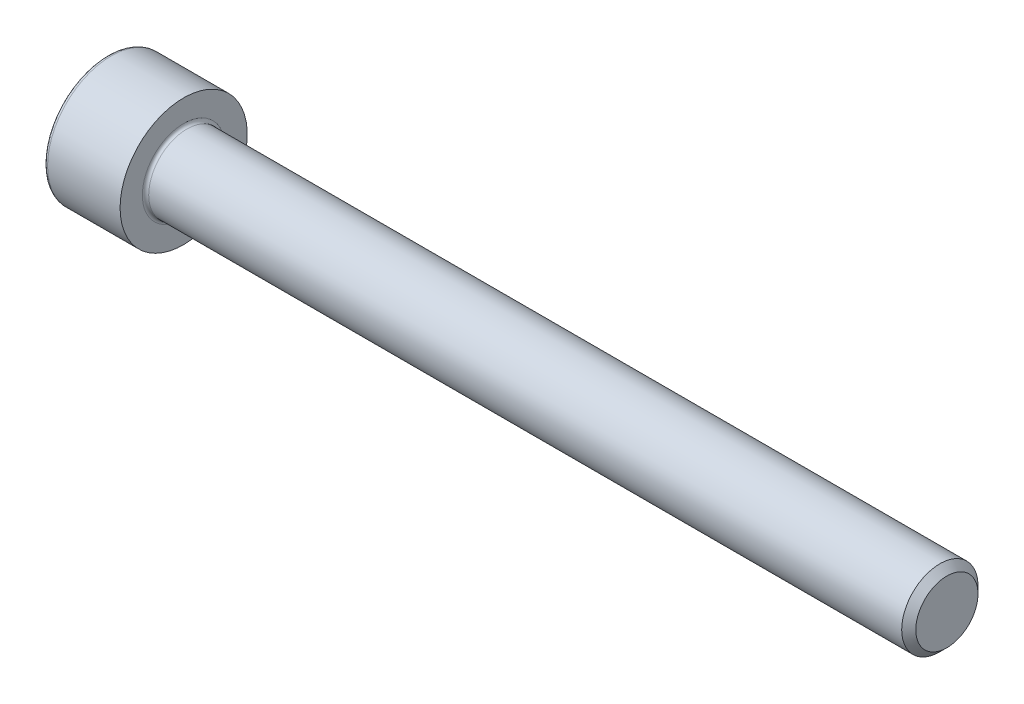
ISO-10303-21;
HEADER;
FILE_DESCRIPTION(('STEP AP214'),'2;1');
FILE_NAME('part.step','',(''),(''),'','','');
FILE_SCHEMA(('AUTOMOTIVE_DESIGN { 1 0 10303 214 1 1 1 1 }'));
ENDSEC;
DATA;
#1=APPLICATION_CONTEXT('core data for automotive mechanical design processes');
#2=APPLICATION_PROTOCOL_DEFINITION('international standard','automotive_design',2000,#1);
#3=PRODUCT_CONTEXT('',#1,'mechanical');
#4=PRODUCT('Part','Part','',(#3));
#5=PRODUCT_RELATED_PRODUCT_CATEGORY('part','',(#4));
#6=PRODUCT_DEFINITION_FORMATION('','',#4);
#7=PRODUCT_DEFINITION_CONTEXT('part definition',#1,'design');
#8=PRODUCT_DEFINITION('design','',#6,#7);
#9=PRODUCT_DEFINITION_SHAPE('','',#8);
#10=(LENGTH_UNIT() NAMED_UNIT(*) SI_UNIT(.MILLI.,.METRE.));
#11=(NAMED_UNIT(*) PLANE_ANGLE_UNIT() SI_UNIT($,.RADIAN.));
#12=(NAMED_UNIT(*) SI_UNIT($,.STERADIAN.) SOLID_ANGLE_UNIT());
#13=UNCERTAINTY_MEASURE_WITH_UNIT(LENGTH_MEASURE(1.E-05),#10,'distance_accuracy_value','');
#14=(GEOMETRIC_REPRESENTATION_CONTEXT(3) GLOBAL_UNCERTAINTY_ASSIGNED_CONTEXT((#13)) GLOBAL_UNIT_ASSIGNED_CONTEXT((#10,
#11,#12)) REPRESENTATION_CONTEXT('',''));
#15=CARTESIAN_POINT('',(0.,0.,0.));
#16=DIRECTION('',(0.,0.,1.));
#17=DIRECTION('',(1.,0.,0.));
#18=AXIS2_PLACEMENT_3D('',#15,#16,#17);
#19=CARTESIAN_POINT('',(0.,0.,0.));
#20=DIRECTION('',(-1.,0.,0.));
#21=DIRECTION('',(0.,0.,1.));
#22=AXIS2_PLACEMENT_3D('',#19,#20,#21);
#23=PLANE('',#22);
#24=DIRECTION('',(0.,-0.499999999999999,0.866025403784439));
#25=VECTOR('',#24,1.);
#26=CARTESIAN_POINT('',(0.,2.93524876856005,0.));
#27=LINE('',#26,#25);
#28=CARTESIAN_POINT('',(0.,2.93524876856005,0.));
#29=VERTEX_POINT('',#28);
#30=CARTESIAN_POINT('',(0.,1.46762438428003,2.542));
#31=VERTEX_POINT('',#30);
#32=EDGE_CURVE('E262',#29,#31,#27,.T.);
#33=ORIENTED_EDGE('',*,*,#32,.T.);
#34=DIRECTION('',(0.,1.,0.));
#35=VECTOR('',#34,1.);
#36=CARTESIAN_POINT('',(0.,-1.46762438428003,2.542));
#37=LINE('',#36,#35);
#38=CARTESIAN_POINT('',(0.,-1.46762438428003,2.542));
#39=VERTEX_POINT('',#38);
#40=EDGE_CURVE('E123',#39,#31,#37,.T.);
#41=ORIENTED_EDGE('',*,*,#40,.F.);
#42=DIRECTION('',(0.,-0.500000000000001,-0.866025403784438));
#43=VECTOR('',#42,1.);
#44=CARTESIAN_POINT('',(0.,-1.46762438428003,2.542));
#45=LINE('',#44,#43);
#46=CARTESIAN_POINT('',(0.,-2.93524876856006,0.));
#47=VERTEX_POINT('',#46);
#48=EDGE_CURVE('E265',#39,#47,#45,.T.);
#49=ORIENTED_EDGE('',*,*,#48,.T.);
#50=DIRECTION('',(0.,0.499999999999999,-0.866025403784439));
#51=VECTOR('',#50,1.);
#52=CARTESIAN_POINT('',(0.,-2.93524876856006,0.));
#53=LINE('',#52,#51);
#54=CARTESIAN_POINT('',(0.,-1.46762438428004,-2.542));
#55=VERTEX_POINT('',#54);
#56=EDGE_CURVE('E268',#47,#55,#53,.T.);
#57=ORIENTED_EDGE('',*,*,#56,.T.);
#58=DIRECTION('',(0.,-1.,0.));
#59=VECTOR('',#58,1.);
#60=CARTESIAN_POINT('',(0.,1.46762438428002,-2.542));
#61=LINE('',#60,#59);
#62=CARTESIAN_POINT('',(0.,1.46762438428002,-2.542));
#63=VERTEX_POINT('',#62);
#64=EDGE_CURVE('E271',#63,#55,#61,.T.);
#65=ORIENTED_EDGE('',*,*,#64,.F.);
#66=DIRECTION('',(0.,-0.500000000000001,-0.866025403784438));
#67=VECTOR('',#66,1.);
#68=CARTESIAN_POINT('',(0.,2.93524876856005,0.));
#69=LINE('',#68,#67);
#70=EDGE_CURVE('E118',#29,#63,#69,.T.);
#71=ORIENTED_EDGE('',*,*,#70,.F.);
#72=EDGE_LOOP('',(#33,#41,#49,#57,#65,#71));
#73=FACE_BOUND('',#72,.T.);
#74=CARTESIAN_POINT('',(0.,0.,0.));
#75=DIRECTION('',(-1.,0.,0.));
#76=DIRECTION('',(0.,0.,1.));
#77=AXIS2_PLACEMENT_3D('',#74,#75,#76);
#78=CIRCLE('',#77,4.7);
#79=CARTESIAN_POINT('',(0.,0.,4.7));
#80=VERTEX_POINT('',#79);
#81=EDGE_CURVE('E39',#80,#80,#78,.T.);
#82=ORIENTED_EDGE('',*,*,#81,.T.);
#83=EDGE_LOOP('',(#82));
#84=FACE_BOUND('',#83,.T.);
#85=ADVANCED_FACE('F31',(#73,#84),#23,.T.);
#86=CARTESIAN_POINT('',(-31.75,0.,0.));
#87=DIRECTION('',(-1.,0.,0.));
#88=DIRECTION('',(0.,0.,1.));
#89=AXIS2_PLACEMENT_3D('',#86,#87,#88);
#90=CYLINDRICAL_SURFACE('',#89,5.);
#91=CARTESIAN_POINT('',(0.300000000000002,0.,0.));
#92=DIRECTION('',(-1.,0.,0.));
#93=DIRECTION('',(0.,0.,1.));
#94=AXIS2_PLACEMENT_3D('',#91,#92,#93);
#95=CIRCLE('',#94,5.);
#96=CARTESIAN_POINT('',(0.300000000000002,0.,5.));
#97=VERTEX_POINT('',#96);
#98=EDGE_CURVE('E11',#97,#97,#95,.F.);
#99=ORIENTED_EDGE('',*,*,#98,.T.);
#100=EDGE_LOOP('',(#99));
#101=FACE_BOUND('',#100,.T.);
#102=CARTESIAN_POINT('',(6.,0.,0.));
#103=DIRECTION('',(-1.,0.,0.));
#104=DIRECTION('',(0.,0.,1.));
#105=AXIS2_PLACEMENT_3D('',#102,#103,#104);
#106=CIRCLE('',#105,5.);
#107=CARTESIAN_POINT('',(6.,0.,5.));
#108=VERTEX_POINT('',#107);
#109=EDGE_CURVE('E141',#108,#108,#106,.T.);
#110=ORIENTED_EDGE('',*,*,#109,.T.);
#111=EDGE_LOOP('',(#110));
#112=FACE_BOUND('',#111,.T.);
#113=ADVANCED_FACE('F165',(#101,#112),#90,.T.);
#114=CARTESIAN_POINT('',(6.,5.,0.));
#115=DIRECTION('',(1.,0.,0.));
#116=DIRECTION('',(0.,0.,-1.));
#117=AXIS2_PLACEMENT_3D('',#114,#115,#116);
#118=PLANE('',#117);
#119=CARTESIAN_POINT('',(6.,0.,0.));
#120=DIRECTION('',(1.,0.,0.));
#121=DIRECTION('',(0.,0.,-1.));
#122=AXIS2_PLACEMENT_3D('',#119,#120,#121);
#123=CIRCLE('',#122,3.24999999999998);
#124=CARTESIAN_POINT('',(6.,0.,-3.24999999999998));
#125=VERTEX_POINT('',#124);
#126=EDGE_CURVE('E144',#125,#125,#123,.F.);
#127=ORIENTED_EDGE('',*,*,#126,.T.);
#128=EDGE_LOOP('',(#127));
#129=FACE_BOUND('',#128,.T.);
#130=ORIENTED_EDGE('',*,*,#109,.F.);
#131=EDGE_LOOP('',(#130));
#132=FACE_BOUND('',#131,.T.);
#133=ADVANCED_FACE('F171',(#129,#132),#118,.T.);
#134=CARTESIAN_POINT('',(-31.75,0.,0.));
#135=DIRECTION('',(-1.,0.,0.));
#136=DIRECTION('',(0.,0.,1.));
#137=AXIS2_PLACEMENT_3D('',#134,#135,#136);
#138=CYLINDRICAL_SURFACE('',#137,2.99999999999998);
#139=CARTESIAN_POINT('',(6.25,0.,0.));
#140=DIRECTION('',(1.,0.,0.));
#141=DIRECTION('',(0.,0.,-1.));
#142=AXIS2_PLACEMENT_3D('',#139,#140,#141);
#143=CIRCLE('',#142,2.99999999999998);
#144=CARTESIAN_POINT('',(6.25,0.,-2.99999999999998));
#145=VERTEX_POINT('',#144);
#146=EDGE_CURVE('E147',#145,#145,#143,.T.);
#147=ORIENTED_EDGE('',*,*,#146,.T.);
#148=EDGE_LOOP('',(#147));
#149=FACE_BOUND('',#148,.T.);
#150=CARTESIAN_POINT('',(65.4455,0.,0.));
#151=DIRECTION('',(-1.,0.,0.));
#152=DIRECTION('',(0.,0.,1.));
#153=AXIS2_PLACEMENT_3D('',#150,#151,#152);
#154=CIRCLE('',#153,2.99999999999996);
#155=CARTESIAN_POINT('',(65.4455,0.,2.99999999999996));
#156=VERTEX_POINT('',#155);
#157=EDGE_CURVE('E138',#156,#156,#154,.T.);
#158=ORIENTED_EDGE('',*,*,#157,.T.);
#159=EDGE_LOOP('',(#158));
#160=FACE_BOUND('',#159,.T.);
#161=ADVANCED_FACE('F177',(#149,#160),#138,.T.);
#162=CARTESIAN_POINT('',(66.,0.,0.));
#163=DIRECTION('',(-1.,0.,0.));
#164=DIRECTION('',(0.,0.,1.));
#165=AXIS2_PLACEMENT_3D('',#162,#163,#164);
#166=CONICAL_SURFACE('',#165,2.4455,0.785398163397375);
#167=ORIENTED_EDGE('',*,*,#157,.F.);
#168=EDGE_LOOP('',(#167));
#169=FACE_BOUND('',#168,.T.);
#170=CARTESIAN_POINT('',(66.,0.,0.));
#171=DIRECTION('',(-1.,0.,0.));
#172=DIRECTION('',(0.,0.,1.));
#173=AXIS2_PLACEMENT_3D('',#170,#171,#172);
#174=CIRCLE('',#173,2.4455);
#175=CARTESIAN_POINT('',(66.,0.,2.4455));
#176=VERTEX_POINT('',#175);
#177=EDGE_CURVE('E134',#176,#176,#174,.T.);
#178=ORIENTED_EDGE('',*,*,#177,.T.);
#179=EDGE_LOOP('',(#178));
#180=FACE_BOUND('',#179,.T.);
#181=ADVANCED_FACE('F181',(#169,#180),#166,.T.);
#182=CARTESIAN_POINT('',(66.,2.4455,0.));
#183=DIRECTION('',(1.,0.,0.));
#184=DIRECTION('',(0.,0.,-1.));
#185=AXIS2_PLACEMENT_3D('',#182,#183,#184);
#186=PLANE('',#185);
#187=ORIENTED_EDGE('',*,*,#177,.F.);
#188=EDGE_LOOP('',(#187));
#189=FACE_BOUND('',#188,.T.);
#190=ADVANCED_FACE('F161',(#189),#186,.T.);
#191=CARTESIAN_POINT('',(6.25,0.,0.));
#192=DIRECTION('',(1.,0.,0.));
#193=DIRECTION('',(0.,0.,-1.));
#194=AXIS2_PLACEMENT_3D('',#191,#192,#193);
#195=TOROIDAL_SURFACE('',#194,3.24999999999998,0.25);
#196=ORIENTED_EDGE('',*,*,#146,.F.);
#197=EDGE_LOOP('',(#196));
#198=FACE_BOUND('',#197,.T.);
#199=ORIENTED_EDGE('',*,*,#126,.F.);
#200=EDGE_LOOP('',(#199));
#201=FACE_BOUND('',#200,.T.);
#202=ADVANCED_FACE('F154',(#198,#201),#195,.F.);
#203=CARTESIAN_POINT('',(0.300000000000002,0.,0.));
#204=DIRECTION('',(-1.,0.,0.));
#205=DIRECTION('',(0.,0.,1.));
#206=AXIS2_PLACEMENT_3D('',#203,#204,#205);
#207=TOROIDAL_SURFACE('',#206,4.7,0.3);
#208=ORIENTED_EDGE('',*,*,#98,.F.);
#209=EDGE_LOOP('',(#208));
#210=FACE_BOUND('',#209,.T.);
#211=ORIENTED_EDGE('',*,*,#81,.F.);
#212=EDGE_LOOP('',(#211));
#213=FACE_BOUND('',#212,.T.);
#214=ADVANCED_FACE('F33',(#210,#213),#207,.T.);
#215=CARTESIAN_POINT('',(3.,2.93524876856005,0.));
#216=DIRECTION('',(0.,-0.866025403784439,-0.499999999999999));
#217=DIRECTION('',(0.,0.499999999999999,-0.866025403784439));
#218=AXIS2_PLACEMENT_3D('',#215,#216,#217);
#219=PLANE('',#218);
#220=ORIENTED_EDGE('',*,*,#32,.F.);
#221=DIRECTION('',(-1.,0.,0.));
#222=VECTOR('',#221,1.);
#223=CARTESIAN_POINT('',(3.,2.93524876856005,0.));
#224=LINE('',#223,#222);
#225=CARTESIAN_POINT('',(3.,2.93524876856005,0.));
#226=VERTEX_POINT('',#225);
#227=EDGE_CURVE('E261',#226,#29,#224,.T.);
#228=ORIENTED_EDGE('',*,*,#227,.F.);
#229=DIRECTION('',(0.,-0.499999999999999,0.866025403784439));
#230=VECTOR('',#229,1.);
#231=CARTESIAN_POINT('',(3.,2.93524876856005,0.));
#232=LINE('',#231,#230);
#233=CARTESIAN_POINT('',(3.,2.20143657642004,1.271));
#234=VERTEX_POINT('',#233);
#235=EDGE_CURVE('E46',#226,#234,#232,.T.);
#236=ORIENTED_EDGE('',*,*,#235,.T.);
#237=CARTESIAN_POINT('',(3.,1.46762438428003,2.542));
#238=VERTEX_POINT('',#237);
#239=EDGE_CURVE('E104',#234,#238,#232,.T.);
#240=ORIENTED_EDGE('',*,*,#239,.T.);
#241=DIRECTION('',(-1.,0.,0.));
#242=VECTOR('',#241,1.);
#243=CARTESIAN_POINT('',(3.,1.46762438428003,2.542));
#244=LINE('',#243,#242);
#245=EDGE_CURVE('E116',#238,#31,#244,.T.);
#246=ORIENTED_EDGE('',*,*,#245,.T.);
#247=EDGE_LOOP('',(#220,#228,#236,#240,#246));
#248=FACE_BOUND('',#247,.T.);
#249=ADVANCED_FACE('F115',(#248),#219,.T.);
#250=CARTESIAN_POINT('',(3.,-1.46762438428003,2.542));
#251=DIRECTION('',(0.,0.,1.));
#252=DIRECTION('',(0.,-1.,0.));
#253=AXIS2_PLACEMENT_3D('',#250,#251,#252);
#254=PLANE('',#253);
#255=ORIENTED_EDGE('',*,*,#40,.T.);
#256=ORIENTED_EDGE('',*,*,#245,.F.);
#257=DIRECTION('',(0.,1.,0.));
#258=VECTOR('',#257,1.);
#259=CARTESIAN_POINT('',(3.,-1.46762438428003,2.542));
#260=LINE('',#259,#258);
#261=CARTESIAN_POINT('',(3.,0.,2.542));
#262=VERTEX_POINT('',#261);
#263=EDGE_CURVE('E102',#262,#238,#260,.T.);
#264=ORIENTED_EDGE('',*,*,#263,.F.);
#265=CARTESIAN_POINT('',(3.,-1.46762438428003,2.542));
#266=VERTEX_POINT('',#265);
#267=EDGE_CURVE('E112',#266,#262,#260,.T.);
#268=ORIENTED_EDGE('',*,*,#267,.F.);
#269=DIRECTION('',(-1.,0.,0.));
#270=VECTOR('',#269,1.);
#271=CARTESIAN_POINT('',(3.,-1.46762438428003,2.542));
#272=LINE('',#271,#270);
#273=EDGE_CURVE('E125',#266,#39,#272,.T.);
#274=ORIENTED_EDGE('',*,*,#273,.T.);
#275=EDGE_LOOP('',(#255,#256,#264,#268,#274));
#276=FACE_BOUND('',#275,.T.);
#277=ADVANCED_FACE('F120',(#276),#254,.F.);
#278=CARTESIAN_POINT('',(3.,-1.46762438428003,2.542));
#279=DIRECTION('',(0.,0.866025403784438,-0.500000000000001));
#280=DIRECTION('',(0.,0.500000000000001,0.866025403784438));
#281=AXIS2_PLACEMENT_3D('',#278,#279,#280);
#282=PLANE('',#281);
#283=ORIENTED_EDGE('',*,*,#48,.F.);
#284=ORIENTED_EDGE('',*,*,#273,.F.);
#285=DIRECTION('',(0.,-0.500000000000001,-0.866025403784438));
#286=VECTOR('',#285,1.);
#287=CARTESIAN_POINT('',(3.,-1.46762438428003,2.542));
#288=LINE('',#287,#286);
#289=CARTESIAN_POINT('',(3.,-2.20143657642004,1.271));
#290=VERTEX_POINT('',#289);
#291=EDGE_CURVE('E242',#266,#290,#288,.T.);
#292=ORIENTED_EDGE('',*,*,#291,.T.);
#293=CARTESIAN_POINT('',(3.,-2.93524876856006,0.));
#294=VERTEX_POINT('',#293);
#295=EDGE_CURVE('E244',#290,#294,#288,.T.);
#296=ORIENTED_EDGE('',*,*,#295,.T.);
#297=DIRECTION('',(-1.,0.,0.));
#298=VECTOR('',#297,1.);
#299=CARTESIAN_POINT('',(3.,-2.93524876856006,0.));
#300=LINE('',#299,#298);
#301=EDGE_CURVE('E130',#294,#47,#300,.T.);
#302=ORIENTED_EDGE('',*,*,#301,.T.);
#303=EDGE_LOOP('',(#283,#284,#292,#296,#302));
#304=FACE_BOUND('',#303,.T.);
#305=ADVANCED_FACE('F194',(#304),#282,.T.);
#306=CARTESIAN_POINT('',(3.,-2.93524876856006,0.));
#307=DIRECTION('',(0.,0.866025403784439,0.499999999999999));
#308=DIRECTION('',(0.,-0.499999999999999,0.866025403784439));
#309=AXIS2_PLACEMENT_3D('',#306,#307,#308);
#310=PLANE('',#309);
#311=ORIENTED_EDGE('',*,*,#56,.F.);
#312=ORIENTED_EDGE('',*,*,#301,.F.);
#313=DIRECTION('',(0.,0.499999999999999,-0.866025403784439));
#314=VECTOR('',#313,1.);
#315=CARTESIAN_POINT('',(3.,-2.93524876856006,0.));
#316=LINE('',#315,#314);
#317=CARTESIAN_POINT('',(3.,-2.20143657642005,-1.271));
#318=VERTEX_POINT('',#317);
#319=EDGE_CURVE('E247',#294,#318,#316,.T.);
#320=ORIENTED_EDGE('',*,*,#319,.T.);
#321=CARTESIAN_POINT('',(3.,-1.46762438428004,-2.542));
#322=VERTEX_POINT('',#321);
#323=EDGE_CURVE('E251',#318,#322,#316,.T.);
#324=ORIENTED_EDGE('',*,*,#323,.T.);
#325=DIRECTION('',(-1.,0.,0.));
#326=VECTOR('',#325,1.);
#327=CARTESIAN_POINT('',(3.,-1.46762438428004,-2.542));
#328=LINE('',#327,#326);
#329=EDGE_CURVE('E280',#322,#55,#328,.T.);
#330=ORIENTED_EDGE('',*,*,#329,.T.);
#331=EDGE_LOOP('',(#311,#312,#320,#324,#330));
#332=FACE_BOUND('',#331,.T.);
#333=ADVANCED_FACE('F197',(#332),#310,.T.);
#334=CARTESIAN_POINT('',(3.,1.46762438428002,-2.542));
#335=DIRECTION('',(0.,0.,-1.));
#336=DIRECTION('',(0.,1.,0.));
#337=AXIS2_PLACEMENT_3D('',#334,#335,#336);
#338=PLANE('',#337);
#339=ORIENTED_EDGE('',*,*,#64,.T.);
#340=ORIENTED_EDGE('',*,*,#329,.F.);
#341=DIRECTION('',(0.,-1.,0.));
#342=VECTOR('',#341,1.);
#343=CARTESIAN_POINT('',(3.,1.46762438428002,-2.542));
#344=LINE('',#343,#342);
#345=CARTESIAN_POINT('',(3.,0.,-2.542));
#346=VERTEX_POINT('',#345);
#347=EDGE_CURVE('E255',#346,#322,#344,.T.);
#348=ORIENTED_EDGE('',*,*,#347,.F.);
#349=CARTESIAN_POINT('',(3.,1.46762438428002,-2.542));
#350=VERTEX_POINT('',#349);
#351=EDGE_CURVE('E256',#350,#346,#344,.T.);
#352=ORIENTED_EDGE('',*,*,#351,.F.);
#353=DIRECTION('',(-1.,0.,0.));
#354=VECTOR('',#353,1.);
#355=CARTESIAN_POINT('',(3.,1.46762438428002,-2.542));
#356=LINE('',#355,#354);
#357=EDGE_CURVE('E277',#350,#63,#356,.T.);
#358=ORIENTED_EDGE('',*,*,#357,.T.);
#359=EDGE_LOOP('',(#339,#340,#348,#352,#358));
#360=FACE_BOUND('',#359,.T.);
#361=ADVANCED_FACE('F201',(#360),#338,.F.);
#362=CARTESIAN_POINT('',(3.,2.93524876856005,0.));
#363=DIRECTION('',(0.,0.866025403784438,-0.500000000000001));
#364=DIRECTION('',(0.,0.500000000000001,0.866025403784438));
#365=AXIS2_PLACEMENT_3D('',#362,#363,#364);
#366=PLANE('',#365);
#367=ORIENTED_EDGE('',*,*,#70,.T.);
#368=ORIENTED_EDGE('',*,*,#357,.F.);
#369=DIRECTION('',(0.,-0.500000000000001,-0.866025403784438));
#370=VECTOR('',#369,1.);
#371=CARTESIAN_POINT('',(3.,2.93524876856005,0.));
#372=LINE('',#371,#370);
#373=CARTESIAN_POINT('',(3.,2.20143657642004,-1.271));
#374=VERTEX_POINT('',#373);
#375=EDGE_CURVE('E259',#374,#350,#372,.T.);
#376=ORIENTED_EDGE('',*,*,#375,.F.);
#377=EDGE_CURVE('E233',#226,#374,#372,.T.);
#378=ORIENTED_EDGE('',*,*,#377,.F.);
#379=ORIENTED_EDGE('',*,*,#227,.T.);
#380=EDGE_LOOP('',(#367,#368,#376,#378,#379));
#381=FACE_BOUND('',#380,.T.);
#382=ADVANCED_FACE('F205',(#381),#366,.F.);
#383=CARTESIAN_POINT('',(3.,1.46762438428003,2.542));
#384=DIRECTION('',(-1.,0.,0.));
#385=DIRECTION('',(0.,0.,1.));
#386=AXIS2_PLACEMENT_3D('',#383,#384,#385);
#387=PLANE('',#386);
#388=CARTESIAN_POINT('',(3.,0.,0.));
#389=DIRECTION('',(-1.,0.,0.));
#390=DIRECTION('',(0.,0.,1.));
#391=AXIS2_PLACEMENT_3D('',#388,#389,#390);
#392=CIRCLE('',#391,2.542);
#393=EDGE_CURVE('E124',#290,#262,#392,.T.);
#394=ORIENTED_EDGE('',*,*,#393,.F.);
#395=ORIENTED_EDGE('',*,*,#291,.F.);
#396=ORIENTED_EDGE('',*,*,#267,.T.);
#397=EDGE_LOOP('',(#394,#395,#396));
#398=FACE_BOUND('',#397,.T.);
#399=ADVANCED_FACE('F209',(#398),#387,.T.);
#400=EDGE_CURVE('E128',#318,#290,#392,.T.);
#401=ORIENTED_EDGE('',*,*,#400,.F.);
#402=ORIENTED_EDGE('',*,*,#319,.F.);
#403=ORIENTED_EDGE('',*,*,#295,.F.);
#404=EDGE_LOOP('',(#401,#402,#403));
#405=FACE_BOUND('',#404,.T.);
#406=ADVANCED_FACE('F212',(#405),#387,.T.);
#407=EDGE_CURVE('E286',#346,#318,#392,.T.);
#408=ORIENTED_EDGE('',*,*,#407,.F.);
#409=ORIENTED_EDGE('',*,*,#347,.T.);
#410=ORIENTED_EDGE('',*,*,#323,.F.);
#411=EDGE_LOOP('',(#408,#409,#410));
#412=FACE_BOUND('',#411,.T.);
#413=ADVANCED_FACE('F217',(#412),#387,.T.);
#414=EDGE_CURVE('E236',#374,#346,#392,.T.);
#415=ORIENTED_EDGE('',*,*,#414,.F.);
#416=ORIENTED_EDGE('',*,*,#375,.T.);
#417=ORIENTED_EDGE('',*,*,#351,.T.);
#418=EDGE_LOOP('',(#415,#416,#417));
#419=FACE_BOUND('',#418,.T.);
#420=ADVANCED_FACE('F224',(#419),#387,.T.);
#421=EDGE_CURVE('E135',#234,#374,#392,.T.);
#422=ORIENTED_EDGE('',*,*,#421,.F.);
#423=ORIENTED_EDGE('',*,*,#235,.F.);
#424=ORIENTED_EDGE('',*,*,#377,.T.);
#425=EDGE_LOOP('',(#422,#423,#424));
#426=FACE_BOUND('',#425,.T.);
#427=ADVANCED_FACE('F220',(#426),#387,.T.);
#428=EDGE_CURVE('E107',#262,#234,#392,.T.);
#429=ORIENTED_EDGE('',*,*,#428,.F.);
#430=ORIENTED_EDGE('',*,*,#263,.T.);
#431=ORIENTED_EDGE('',*,*,#239,.F.);
#432=EDGE_LOOP('',(#429,#430,#431));
#433=FACE_BOUND('',#432,.T.);
#434=ADVANCED_FACE('F103',(#433),#387,.T.);
#435=CARTESIAN_POINT('',(3.,0.,0.));
#436=DIRECTION('',(-1.,0.,0.));
#437=DIRECTION('',(0.,0.,1.));
#438=AXIS2_PLACEMENT_3D('',#435,#436,#437);
#439=CONICAL_SURFACE('',#438,2.542,1.04719755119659);
#440=CARTESIAN_POINT('',(4.46762438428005,0.,0.));
#441=VERTEX_POINT('',#440);
#442=VERTEX_LOOP('',#441);
#443=FACE_BOUND('',#442,.T.);
#444=ORIENTED_EDGE('',*,*,#428,.T.);
#445=ORIENTED_EDGE('',*,*,#421,.T.);
#446=ORIENTED_EDGE('',*,*,#414,.T.);
#447=ORIENTED_EDGE('',*,*,#407,.T.);
#448=ORIENTED_EDGE('',*,*,#400,.T.);
#449=ORIENTED_EDGE('',*,*,#393,.T.);
#450=EDGE_LOOP('',(#444,#445,#446,#447,#448,#449));
#451=FACE_BOUND('',#450,.T.);
#452=ADVANCED_FACE('F189',(#443,#451),#439,.F.);
#453=CLOSED_SHELL('',(#85,#113,#133,#161,#181,#190,#202,#214,#249,#277,#305,#333,#361,#382,#399,
#406,#413,#420,#427,#434,#452));
#454=MANIFOLD_SOLID_BREP('B2',#453);
#455=ADVANCED_BREP_SHAPE_REPRESENTATION('',(#18,#454),#14);
#456=SHAPE_DEFINITION_REPRESENTATION(#9,#455);
ENDSEC;
END-ISO-10303-21;
